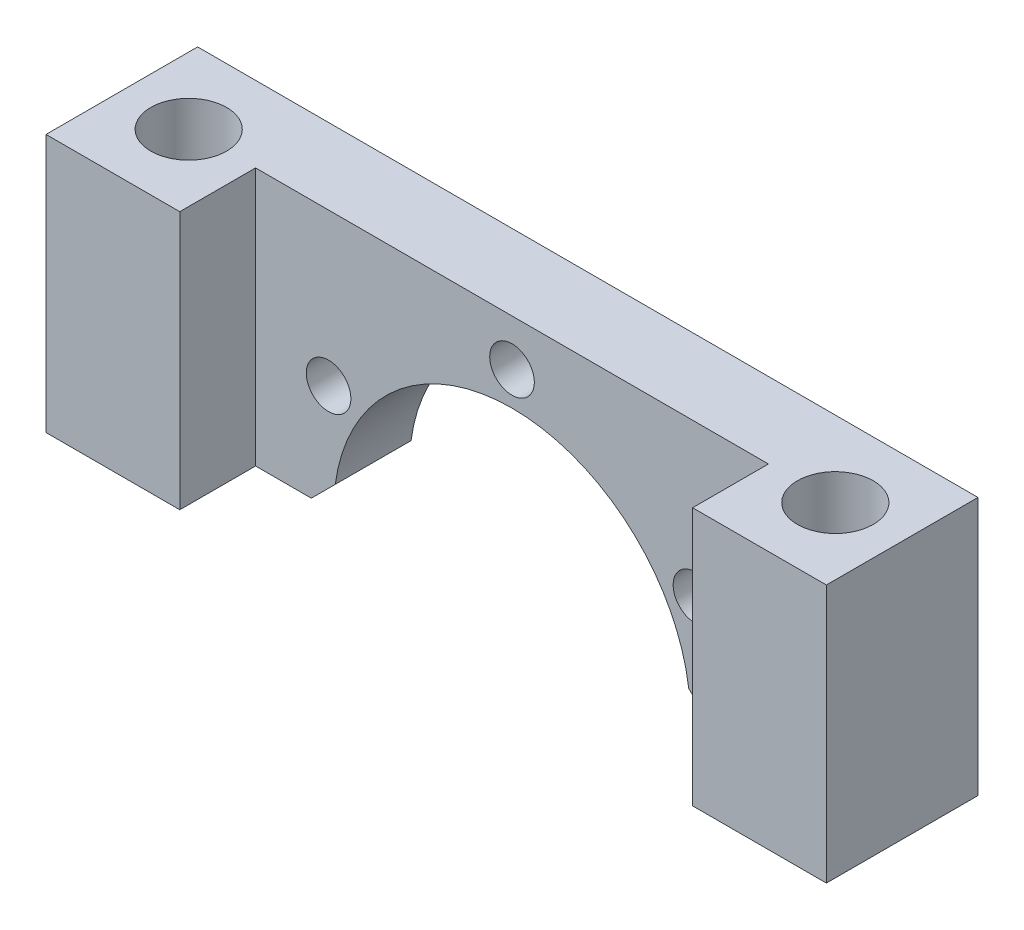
ISO-10303-21;
HEADER;
FILE_DESCRIPTION(('STEP AP214'),'2;1');
FILE_NAME('part.step','',(''),(''),'','','');
FILE_SCHEMA(('AUTOMOTIVE_DESIGN { 1 0 10303 214 1 1 1 1 }'));
ENDSEC;
DATA;
#1=APPLICATION_CONTEXT('core data for automotive mechanical design processes');
#2=APPLICATION_PROTOCOL_DEFINITION('international standard','automotive_design',2000,#1);
#3=PRODUCT_CONTEXT('',#1,'mechanical');
#4=PRODUCT('Part','Part','',(#3));
#5=PRODUCT_RELATED_PRODUCT_CATEGORY('part','',(#4));
#6=PRODUCT_DEFINITION_FORMATION('','',#4);
#7=PRODUCT_DEFINITION_CONTEXT('part definition',#1,'design');
#8=PRODUCT_DEFINITION('design','',#6,#7);
#9=PRODUCT_DEFINITION_SHAPE('','',#8);
#10=(LENGTH_UNIT() NAMED_UNIT(*) SI_UNIT(.MILLI.,.METRE.));
#11=(NAMED_UNIT(*) PLANE_ANGLE_UNIT() SI_UNIT($,.RADIAN.));
#12=(NAMED_UNIT(*) SI_UNIT($,.STERADIAN.) SOLID_ANGLE_UNIT());
#13=UNCERTAINTY_MEASURE_WITH_UNIT(LENGTH_MEASURE(1.E-05),#10,'distance_accuracy_value','');
#14=(GEOMETRIC_REPRESENTATION_CONTEXT(3) GLOBAL_UNCERTAINTY_ASSIGNED_CONTEXT((#13)) GLOBAL_UNIT_ASSIGNED_CONTEXT((#10,
#11,#12)) REPRESENTATION_CONTEXT('',''));
#15=CARTESIAN_POINT('',(0.,0.,0.));
#16=DIRECTION('',(0.,0.,1.));
#17=DIRECTION('',(1.,0.,0.));
#18=AXIS2_PLACEMENT_3D('',#15,#16,#17);
#19=CARTESIAN_POINT('',(0.,0.,3.4));
#20=DIRECTION('',(0.,0.,-1.));
#21=DIRECTION('',(-1.,0.,0.));
#22=AXIS2_PLACEMENT_3D('',#19,#20,#21);
#23=PLANE('',#22);
#24=CARTESIAN_POINT('',(8.22724133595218,4.74999999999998,3.4));
#25=DIRECTION('',(0.,0.,-1.));
#26=DIRECTION('',(-1.,0.,0.));
#27=AXIS2_PLACEMENT_3D('',#24,#25,#26);
#28=CIRCLE('',#27,1.);
#29=CARTESIAN_POINT('',(7.22724133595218,4.74999999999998,3.4));
#30=VERTEX_POINT('',#29);
#31=EDGE_CURVE('E358',#30,#30,#28,.T.);
#32=ORIENTED_EDGE('',*,*,#31,.T.);
#33=EDGE_LOOP('',(#32));
#34=FACE_BOUND('',#33,.T.);
#35=CARTESIAN_POINT('',(0.,9.5,3.4));
#36=DIRECTION('',(0.,0.,-1.));
#37=DIRECTION('',(-1.,0.,0.));
#38=AXIS2_PLACEMENT_3D('',#35,#36,#37);
#39=CIRCLE('',#38,1.);
#40=CARTESIAN_POINT('',(-1.,9.5,3.4));
#41=VERTEX_POINT('',#40);
#42=EDGE_CURVE('E365',#41,#41,#39,.T.);
#43=ORIENTED_EDGE('',*,*,#42,.T.);
#44=EDGE_LOOP('',(#43));
#45=FACE_BOUND('',#44,.T.);
#46=CARTESIAN_POINT('',(-8.22724133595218,4.74999999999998,3.4));
#47=DIRECTION('',(0.,0.,-1.));
#48=DIRECTION('',(-1.,0.,0.));
#49=AXIS2_PLACEMENT_3D('',#46,#47,#48);
#50=CIRCLE('',#49,1.);
#51=CARTESIAN_POINT('',(-9.22724133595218,4.74999999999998,3.4));
#52=VERTEX_POINT('',#51);
#53=EDGE_CURVE('E369',#52,#52,#50,.T.);
#54=ORIENTED_EDGE('',*,*,#53,.T.);
#55=EDGE_LOOP('',(#54));
#56=FACE_BOUND('',#55,.T.);
#57=DIRECTION('',(1.,0.,0.));
#58=VECTOR('',#57,1.);
#59=CARTESIAN_POINT('',(-8.,0.,3.4));
#60=LINE('',#59,#58);
#61=CARTESIAN_POINT('',(-11.5,0.,3.4));
#62=VERTEX_POINT('',#61);
#63=CARTESIAN_POINT('',(-9.,0.,3.4));
#64=VERTEX_POINT('',#63);
#65=EDGE_CURVE('E222',#62,#64,#60,.T.);
#66=ORIENTED_EDGE('',*,*,#65,.T.);
#67=DIRECTION('',(-0.707106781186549,-0.707106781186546,0.));
#68=VECTOR('',#67,1.);
#69=CARTESIAN_POINT('',(-7.92782730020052,1.07217269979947,3.4));
#70=LINE('',#69,#68);
#71=CARTESIAN_POINT('',(-7.92782730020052,1.07217269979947,3.4));
#72=VERTEX_POINT('',#71);
#73=EDGE_CURVE('E51',#64,#72,#70,.F.);
#74=ORIENTED_EDGE('',*,*,#73,.T.);
#75=CARTESIAN_POINT('',(0.,0.,3.4));
#76=DIRECTION('',(0.,0.,-1.));
#77=DIRECTION('',(-1.,0.,0.));
#78=AXIS2_PLACEMENT_3D('',#75,#76,#77);
#79=CIRCLE('',#78,8.);
#80=CARTESIAN_POINT('',(7.92782730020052,1.07217269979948,3.4));
#81=VERTEX_POINT('',#80);
#82=EDGE_CURVE('E212',#72,#81,#79,.T.);
#83=ORIENTED_EDGE('',*,*,#82,.T.);
#84=DIRECTION('',(-0.707106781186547,0.707106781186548,0.));
#85=VECTOR('',#84,1.);
#86=CARTESIAN_POINT('',(9.,0.,3.4));
#87=LINE('',#86,#85);
#88=CARTESIAN_POINT('',(9.,0.,3.4));
#89=VERTEX_POINT('',#88);
#90=EDGE_CURVE('E58',#81,#89,#87,.F.);
#91=ORIENTED_EDGE('',*,*,#90,.T.);
#92=DIRECTION('',(1.,0.,0.));
#93=VECTOR('',#92,1.);
#94=CARTESIAN_POINT('',(17.5,0.,3.4));
#95=LINE('',#94,#93);
#96=CARTESIAN_POINT('',(11.5,0.,3.4));
#97=VERTEX_POINT('',#96);
#98=EDGE_CURVE('E215',#89,#97,#95,.T.);
#99=ORIENTED_EDGE('',*,*,#98,.T.);
#100=DIRECTION('',(0.,-1.,0.));
#101=VECTOR('',#100,1.);
#102=CARTESIAN_POINT('',(11.5,11.58,3.4));
#103=LINE('',#102,#101);
#104=CARTESIAN_POINT('',(11.5,11.58,3.4));
#105=VERTEX_POINT('',#104);
#106=EDGE_CURVE('E164',#105,#97,#103,.T.);
#107=ORIENTED_EDGE('',*,*,#106,.F.);
#108=DIRECTION('',(-1.,0.,0.));
#109=VECTOR('',#108,1.);
#110=CARTESIAN_POINT('',(-17.5,11.58,3.4));
#111=LINE('',#110,#109);
#112=CARTESIAN_POINT('',(-11.5,11.58,3.4));
#113=VERTEX_POINT('',#112);
#114=EDGE_CURVE('E219',#105,#113,#111,.T.);
#115=ORIENTED_EDGE('',*,*,#114,.T.);
#116=DIRECTION('',(0.,1.,0.));
#117=VECTOR('',#116,1.);
#118=CARTESIAN_POINT('',(-11.5,11.58,3.4));
#119=LINE('',#118,#117);
#120=EDGE_CURVE('E185',#62,#113,#119,.T.);
#121=ORIENTED_EDGE('',*,*,#120,.F.);
#122=EDGE_LOOP('',(#66,#74,#83,#91,#99,#107,#115,#121));
#123=FACE_BOUND('',#122,.T.);
#124=ADVANCED_FACE('F41',(#34,#45,#56,#123),#23,.F.);
#125=CARTESIAN_POINT('',(0.,0.,3.4));
#126=DIRECTION('',(0.,0.,-1.));
#127=DIRECTION('',(-1.,0.,0.));
#128=AXIS2_PLACEMENT_3D('',#125,#126,#127);
#129=CYLINDRICAL_SURFACE('',#128,8.);
#130=ORIENTED_EDGE('',*,*,#82,.F.);
#131=DIRECTION('',(0.,0.,-1.));
#132=VECTOR('',#131,1.);
#133=CARTESIAN_POINT('',(-7.92782730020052,1.07217269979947,3.4));
#134=LINE('',#133,#132);
#135=CARTESIAN_POINT('',(-7.92782730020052,1.07217269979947,0.));
#136=VERTEX_POINT('',#135);
#137=EDGE_CURVE('E253',#72,#136,#134,.T.);
#138=ORIENTED_EDGE('',*,*,#137,.T.);
#139=CARTESIAN_POINT('',(0.,0.,0.));
#140=DIRECTION('',(0.,0.,-1.));
#141=DIRECTION('',(-1.,0.,0.));
#142=AXIS2_PLACEMENT_3D('',#139,#140,#141);
#143=CIRCLE('',#142,8.);
#144=CARTESIAN_POINT('',(7.92782730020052,1.07217269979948,0.));
#145=VERTEX_POINT('',#144);
#146=EDGE_CURVE('E211',#136,#145,#143,.T.);
#147=ORIENTED_EDGE('',*,*,#146,.T.);
#148=DIRECTION('',(0.,0.,-1.));
#149=VECTOR('',#148,1.);
#150=CARTESIAN_POINT('',(7.92782730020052,1.07217269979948,3.4));
#151=LINE('',#150,#149);
#152=EDGE_CURVE('E250',#145,#81,#151,.F.);
#153=ORIENTED_EDGE('',*,*,#152,.T.);
#154=EDGE_LOOP('',(#130,#138,#147,#153));
#155=FACE_BOUND('',#154,.T.);
#156=ADVANCED_FACE('F273',(#155),#129,.F.);
#157=CARTESIAN_POINT('',(17.5,0.,3.4));
#158=DIRECTION('',(0.,1.,0.));
#159=DIRECTION('',(-1.,0.,0.));
#160=AXIS2_PLACEMENT_3D('',#157,#158,#159);
#161=PLANE('',#160);
#162=CARTESIAN_POINT('',(14.5,0.,3.4));
#163=DIRECTION('',(0.,1.,0.));
#164=DIRECTION('',(0.,0.,-1.));
#165=AXIS2_PLACEMENT_3D('',#162,#163,#164);
#166=CIRCLE('',#165,1.7);
#167=CARTESIAN_POINT('',(14.5,0.,1.7));
#168=VERTEX_POINT('',#167);
#169=EDGE_CURVE('E348',#168,#168,#166,.T.);
#170=ORIENTED_EDGE('',*,*,#169,.T.);
#171=EDGE_LOOP('',(#170));
#172=FACE_BOUND('',#171,.T.);
#173=ORIENTED_EDGE('',*,*,#98,.F.);
#174=DIRECTION('',(0.,0.,-1.));
#175=VECTOR('',#174,1.);
#176=CARTESIAN_POINT('',(9.,0.,3.4));
#177=LINE('',#176,#175);
#178=CARTESIAN_POINT('',(9.,0.,0.));
#179=VERTEX_POINT('',#178);
#180=EDGE_CURVE('E11',#89,#179,#177,.T.);
#181=ORIENTED_EDGE('',*,*,#180,.T.);
#182=DIRECTION('',(1.,0.,0.));
#183=VECTOR('',#182,1.);
#184=CARTESIAN_POINT('',(17.5,0.,0.));
#185=LINE('',#184,#183);
#186=CARTESIAN_POINT('',(17.5,0.,0.));
#187=VERTEX_POINT('',#186);
#188=EDGE_CURVE('E229',#179,#187,#185,.T.);
#189=ORIENTED_EDGE('',*,*,#188,.T.);
#190=DIRECTION('',(0.,0.,-1.));
#191=VECTOR('',#190,1.);
#192=CARTESIAN_POINT('',(17.5,0.,3.4));
#193=LINE('',#192,#191);
#194=CARTESIAN_POINT('',(17.5,0.,6.8));
#195=VERTEX_POINT('',#194);
#196=EDGE_CURVE('E146',#195,#187,#193,.T.);
#197=ORIENTED_EDGE('',*,*,#196,.F.);
#198=DIRECTION('',(1.,0.,0.));
#199=VECTOR('',#198,1.);
#200=CARTESIAN_POINT('',(17.5,0.,6.8));
#201=LINE('',#200,#199);
#202=CARTESIAN_POINT('',(11.5,0.,6.8));
#203=VERTEX_POINT('',#202);
#204=EDGE_CURVE('E162',#203,#195,#201,.T.);
#205=ORIENTED_EDGE('',*,*,#204,.F.);
#206=DIRECTION('',(0.,0.,-1.));
#207=VECTOR('',#206,1.);
#208=CARTESIAN_POINT('',(11.5,0.,6.8));
#209=LINE('',#208,#207);
#210=EDGE_CURVE('E178',#203,#97,#209,.T.);
#211=ORIENTED_EDGE('',*,*,#210,.T.);
#212=EDGE_LOOP('',(#173,#181,#189,#197,#205,#211));
#213=FACE_BOUND('',#212,.T.);
#214=ADVANCED_FACE('F300',(#172,#213),#161,.F.);
#215=CARTESIAN_POINT('',(17.5,11.58,3.4));
#216=DIRECTION('',(-1.,0.,0.));
#217=DIRECTION('',(0.,0.,1.));
#218=AXIS2_PLACEMENT_3D('',#215,#216,#217);
#219=PLANE('',#218);
#220=DIRECTION('',(0.,1.,0.));
#221=VECTOR('',#220,1.);
#222=CARTESIAN_POINT('',(17.5,11.58,0.));
#223=LINE('',#222,#221);
#224=CARTESIAN_POINT('',(17.5,11.58,0.));
#225=VERTEX_POINT('',#224);
#226=EDGE_CURVE('E142',#187,#225,#223,.T.);
#227=ORIENTED_EDGE('',*,*,#226,.T.);
#228=DIRECTION('',(0.,0.,-1.));
#229=VECTOR('',#228,1.);
#230=CARTESIAN_POINT('',(17.5,11.58,3.4));
#231=LINE('',#230,#229);
#232=CARTESIAN_POINT('',(17.5,11.58,6.8));
#233=VERTEX_POINT('',#232);
#234=EDGE_CURVE('E135',#233,#225,#231,.T.);
#235=ORIENTED_EDGE('',*,*,#234,.F.);
#236=DIRECTION('',(0.,1.,0.));
#237=VECTOR('',#236,1.);
#238=CARTESIAN_POINT('',(17.5,11.58,6.8));
#239=LINE('',#238,#237);
#240=EDGE_CURVE('E140',#195,#233,#239,.T.);
#241=ORIENTED_EDGE('',*,*,#240,.F.);
#242=ORIENTED_EDGE('',*,*,#196,.T.);
#243=EDGE_LOOP('',(#227,#235,#241,#242));
#244=FACE_BOUND('',#243,.T.);
#245=ADVANCED_FACE('F137',(#244),#219,.F.);
#246=CARTESIAN_POINT('',(-17.5,11.58,3.4));
#247=DIRECTION('',(0.,-1.,0.));
#248=DIRECTION('',(0.,0.,-1.));
#249=AXIS2_PLACEMENT_3D('',#246,#247,#248);
#250=PLANE('',#249);
#251=CARTESIAN_POINT('',(-14.5,11.58,3.4));
#252=DIRECTION('',(0.,1.,0.));
#253=DIRECTION('',(0.,0.,1.));
#254=AXIS2_PLACEMENT_3D('',#251,#252,#253);
#255=CIRCLE('',#254,1.7);
#256=CARTESIAN_POINT('',(-14.5,11.58,5.1));
#257=VERTEX_POINT('',#256);
#258=EDGE_CURVE('E351',#257,#257,#255,.T.);
#259=ORIENTED_EDGE('',*,*,#258,.F.);
#260=EDGE_LOOP('',(#259));
#261=FACE_BOUND('',#260,.T.);
#262=CARTESIAN_POINT('',(14.5,11.58,3.4));
#263=DIRECTION('',(0.,1.,0.));
#264=DIRECTION('',(0.,0.,-1.));
#265=AXIS2_PLACEMENT_3D('',#262,#263,#264);
#266=CIRCLE('',#265,1.7);
#267=CARTESIAN_POINT('',(14.5,11.58,1.7));
#268=VERTEX_POINT('',#267);
#269=EDGE_CURVE('E172',#268,#268,#266,.T.);
#270=ORIENTED_EDGE('',*,*,#269,.F.);
#271=EDGE_LOOP('',(#270));
#272=FACE_BOUND('',#271,.T.);
#273=DIRECTION('',(-1.,0.,0.));
#274=VECTOR('',#273,1.);
#275=CARTESIAN_POINT('',(-17.5,11.58,0.));
#276=LINE('',#275,#274);
#277=CARTESIAN_POINT('',(-17.5,11.58,0.));
#278=VERTEX_POINT('',#277);
#279=EDGE_CURVE('E234',#225,#278,#276,.T.);
#280=ORIENTED_EDGE('',*,*,#279,.T.);
#281=DIRECTION('',(0.,0.,-1.));
#282=VECTOR('',#281,1.);
#283=CARTESIAN_POINT('',(-17.5,11.58,3.4));
#284=LINE('',#283,#282);
#285=CARTESIAN_POINT('',(-17.5,11.58,6.8));
#286=VERTEX_POINT('',#285);
#287=EDGE_CURVE('E147',#286,#278,#284,.T.);
#288=ORIENTED_EDGE('',*,*,#287,.F.);
#289=DIRECTION('',(-1.,0.,0.));
#290=VECTOR('',#289,1.);
#291=CARTESIAN_POINT('',(-17.5,11.58,6.8));
#292=LINE('',#291,#290);
#293=CARTESIAN_POINT('',(-11.5,11.58,6.8));
#294=VERTEX_POINT('',#293);
#295=EDGE_CURVE('E196',#294,#286,#292,.T.);
#296=ORIENTED_EDGE('',*,*,#295,.F.);
#297=DIRECTION('',(0.,0.,-1.));
#298=VECTOR('',#297,1.);
#299=CARTESIAN_POINT('',(-11.5,11.58,6.8));
#300=LINE('',#299,#298);
#301=EDGE_CURVE('E200',#294,#113,#300,.T.);
#302=ORIENTED_EDGE('',*,*,#301,.T.);
#303=ORIENTED_EDGE('',*,*,#114,.F.);
#304=DIRECTION('',(0.,0.,-1.));
#305=VECTOR('',#304,1.);
#306=CARTESIAN_POINT('',(11.5,11.58,6.8));
#307=LINE('',#306,#305);
#308=CARTESIAN_POINT('',(11.5,11.58,6.8));
#309=VERTEX_POINT('',#308);
#310=EDGE_CURVE('E153',#309,#105,#307,.T.);
#311=ORIENTED_EDGE('',*,*,#310,.F.);
#312=DIRECTION('',(-1.,0.,0.));
#313=VECTOR('',#312,1.);
#314=CARTESIAN_POINT('',(17.5,11.58,6.8));
#315=LINE('',#314,#313);
#316=EDGE_CURVE('E150',#233,#309,#315,.T.);
#317=ORIENTED_EDGE('',*,*,#316,.F.);
#318=ORIENTED_EDGE('',*,*,#234,.T.);
#319=EDGE_LOOP('',(#280,#288,#296,#302,#303,#311,#317,#318));
#320=FACE_BOUND('',#319,.T.);
#321=ADVANCED_FACE('F151',(#261,#272,#320),#250,.F.);
#322=CARTESIAN_POINT('',(-17.5,0.,3.4));
#323=DIRECTION('',(1.,0.,0.));
#324=DIRECTION('',(0.,0.,-1.));
#325=AXIS2_PLACEMENT_3D('',#322,#323,#324);
#326=PLANE('',#325);
#327=DIRECTION('',(0.,-1.,0.));
#328=VECTOR('',#327,1.);
#329=CARTESIAN_POINT('',(-17.5,0.,0.));
#330=LINE('',#329,#328);
#331=CARTESIAN_POINT('',(-17.5,0.,0.));
#332=VERTEX_POINT('',#331);
#333=EDGE_CURVE('E237',#278,#332,#330,.T.);
#334=ORIENTED_EDGE('',*,*,#333,.T.);
#335=DIRECTION('',(0.,0.,-1.));
#336=VECTOR('',#335,1.);
#337=CARTESIAN_POINT('',(-17.5,0.,3.4));
#338=LINE('',#337,#336);
#339=CARTESIAN_POINT('',(-17.5,0.,6.8));
#340=VERTEX_POINT('',#339);
#341=EDGE_CURVE('E225',#340,#332,#338,.T.);
#342=ORIENTED_EDGE('',*,*,#341,.F.);
#343=DIRECTION('',(0.,-1.,0.));
#344=VECTOR('',#343,1.);
#345=CARTESIAN_POINT('',(-17.5,11.58,6.8));
#346=LINE('',#345,#344);
#347=EDGE_CURVE('E186',#286,#340,#346,.T.);
#348=ORIENTED_EDGE('',*,*,#347,.F.);
#349=ORIENTED_EDGE('',*,*,#287,.T.);
#350=EDGE_LOOP('',(#334,#342,#348,#349));
#351=FACE_BOUND('',#350,.T.);
#352=ADVANCED_FACE('F286',(#351),#326,.F.);
#353=CARTESIAN_POINT('',(-8.,0.,3.4));
#354=DIRECTION('',(0.,1.,0.));
#355=DIRECTION('',(-1.,0.,0.));
#356=AXIS2_PLACEMENT_3D('',#353,#354,#355);
#357=PLANE('',#356);
#358=CARTESIAN_POINT('',(-14.5,0.,3.4));
#359=DIRECTION('',(0.,1.,0.));
#360=DIRECTION('',(0.,0.,1.));
#361=AXIS2_PLACEMENT_3D('',#358,#359,#360);
#362=CIRCLE('',#361,1.7);
#363=CARTESIAN_POINT('',(-14.5,0.,5.1));
#364=VERTEX_POINT('',#363);
#365=EDGE_CURVE('E169',#364,#364,#362,.T.);
#366=ORIENTED_EDGE('',*,*,#365,.T.);
#367=EDGE_LOOP('',(#366));
#368=FACE_BOUND('',#367,.T.);
#369=DIRECTION('',(1.,0.,0.));
#370=VECTOR('',#369,1.);
#371=CARTESIAN_POINT('',(-8.,0.,0.));
#372=LINE('',#371,#370);
#373=CARTESIAN_POINT('',(-9.,0.,0.));
#374=VERTEX_POINT('',#373);
#375=EDGE_CURVE('E216',#332,#374,#372,.T.);
#376=ORIENTED_EDGE('',*,*,#375,.T.);
#377=DIRECTION('',(0.,0.,1.));
#378=VECTOR('',#377,1.);
#379=CARTESIAN_POINT('',(-9.,0.,3.4));
#380=LINE('',#379,#378);
#381=EDGE_CURVE('E66',#374,#64,#380,.T.);
#382=ORIENTED_EDGE('',*,*,#381,.T.);
#383=ORIENTED_EDGE('',*,*,#65,.F.);
#384=DIRECTION('',(0.,0.,-1.));
#385=VECTOR('',#384,1.);
#386=CARTESIAN_POINT('',(-11.5,0.,6.8));
#387=LINE('',#386,#385);
#388=CARTESIAN_POINT('',(-11.5,0.,6.8));
#389=VERTEX_POINT('',#388);
#390=EDGE_CURVE('E207',#389,#62,#387,.T.);
#391=ORIENTED_EDGE('',*,*,#390,.F.);
#392=DIRECTION('',(1.,0.,0.));
#393=VECTOR('',#392,1.);
#394=CARTESIAN_POINT('',(-17.5,0.,6.8));
#395=LINE('',#394,#393);
#396=EDGE_CURVE('E190',#340,#389,#395,.T.);
#397=ORIENTED_EDGE('',*,*,#396,.F.);
#398=ORIENTED_EDGE('',*,*,#341,.T.);
#399=EDGE_LOOP('',(#376,#382,#383,#391,#397,#398));
#400=FACE_BOUND('',#399,.T.);
#401=ADVANCED_FACE('F281',(#368,#400),#357,.F.);
#402=CARTESIAN_POINT('',(0.,0.,0.));
#403=DIRECTION('',(0.,0.,-1.));
#404=DIRECTION('',(-1.,0.,0.));
#405=AXIS2_PLACEMENT_3D('',#402,#403,#404);
#406=PLANE('',#405);
#407=CARTESIAN_POINT('',(8.22724133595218,4.74999999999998,0.));
#408=DIRECTION('',(0.,0.,-1.));
#409=DIRECTION('',(-1.,0.,0.));
#410=AXIS2_PLACEMENT_3D('',#407,#408,#409);
#411=CIRCLE('',#410,1.);
#412=CARTESIAN_POINT('',(7.22724133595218,4.74999999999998,0.));
#413=VERTEX_POINT('',#412);
#414=EDGE_CURVE('E373',#413,#413,#411,.T.);
#415=ORIENTED_EDGE('',*,*,#414,.F.);
#416=EDGE_LOOP('',(#415));
#417=FACE_BOUND('',#416,.T.);
#418=CARTESIAN_POINT('',(0.,9.5,0.));
#419=DIRECTION('',(0.,0.,-1.));
#420=DIRECTION('',(-1.,0.,0.));
#421=AXIS2_PLACEMENT_3D('',#418,#419,#420);
#422=CIRCLE('',#421,1.);
#423=CARTESIAN_POINT('',(-1.,9.5,0.));
#424=VERTEX_POINT('',#423);
#425=EDGE_CURVE('E378',#424,#424,#422,.T.);
#426=ORIENTED_EDGE('',*,*,#425,.F.);
#427=EDGE_LOOP('',(#426));
#428=FACE_BOUND('',#427,.T.);
#429=CARTESIAN_POINT('',(-8.22724133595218,4.74999999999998,0.));
#430=DIRECTION('',(0.,0.,-1.));
#431=DIRECTION('',(-1.,0.,0.));
#432=AXIS2_PLACEMENT_3D('',#429,#430,#431);
#433=CIRCLE('',#432,1.);
#434=CARTESIAN_POINT('',(-9.22724133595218,4.74999999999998,0.));
#435=VERTEX_POINT('',#434);
#436=EDGE_CURVE('E374',#435,#435,#433,.T.);
#437=ORIENTED_EDGE('',*,*,#436,.F.);
#438=EDGE_LOOP('',(#437));
#439=FACE_BOUND('',#438,.T.);
#440=ORIENTED_EDGE('',*,*,#146,.F.);
#441=DIRECTION('',(0.707106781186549,0.707106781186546,0.));
#442=VECTOR('',#441,1.);
#443=CARTESIAN_POINT('',(-4.49999999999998,4.5,0.));
#444=LINE('',#443,#442);
#445=EDGE_CURVE('E260',#136,#374,#444,.F.);
#446=ORIENTED_EDGE('',*,*,#445,.T.);
#447=ORIENTED_EDGE('',*,*,#375,.F.);
#448=ORIENTED_EDGE('',*,*,#333,.F.);
#449=ORIENTED_EDGE('',*,*,#279,.F.);
#450=ORIENTED_EDGE('',*,*,#226,.F.);
#451=ORIENTED_EDGE('',*,*,#188,.F.);
#452=DIRECTION('',(0.707106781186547,-0.707106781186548,0.));
#453=VECTOR('',#452,1.);
#454=CARTESIAN_POINT('',(4.5,4.5,0.));
#455=LINE('',#454,#453);
#456=EDGE_CURVE('E257',#179,#145,#455,.F.);
#457=ORIENTED_EDGE('',*,*,#456,.T.);
#458=EDGE_LOOP('',(#440,#446,#447,#448,#449,#450,#451,#457));
#459=FACE_BOUND('',#458,.T.);
#460=ADVANCED_FACE('F279',(#417,#428,#439,#459),#406,.T.);
#461=CARTESIAN_POINT('',(-11.5,11.58,6.8));
#462=DIRECTION('',(-1.,0.,0.));
#463=DIRECTION('',(0.,-1.,0.));
#464=AXIS2_PLACEMENT_3D('',#461,#462,#463);
#465=PLANE('',#464);
#466=ORIENTED_EDGE('',*,*,#120,.T.);
#467=ORIENTED_EDGE('',*,*,#301,.F.);
#468=DIRECTION('',(0.,1.,0.));
#469=VECTOR('',#468,1.);
#470=CARTESIAN_POINT('',(-11.5,11.58,6.8));
#471=LINE('',#470,#469);
#472=EDGE_CURVE('E193',#389,#294,#471,.T.);
#473=ORIENTED_EDGE('',*,*,#472,.F.);
#474=ORIENTED_EDGE('',*,*,#390,.T.);
#475=EDGE_LOOP('',(#466,#467,#473,#474));
#476=FACE_BOUND('',#475,.T.);
#477=ADVANCED_FACE('F294',(#476),#465,.F.);
#478=CARTESIAN_POINT('',(0.,0.,6.8));
#479=DIRECTION('',(0.,0.,1.));
#480=DIRECTION('',(1.,0.,0.));
#481=AXIS2_PLACEMENT_3D('',#478,#479,#480);
#482=PLANE('',#481);
#483=ORIENTED_EDGE('',*,*,#347,.T.);
#484=ORIENTED_EDGE('',*,*,#396,.T.);
#485=ORIENTED_EDGE('',*,*,#472,.T.);
#486=ORIENTED_EDGE('',*,*,#295,.T.);
#487=EDGE_LOOP('',(#483,#484,#485,#486));
#488=FACE_BOUND('',#487,.T.);
#489=ADVANCED_FACE('F290',(#488),#482,.T.);
#490=CARTESIAN_POINT('',(11.5,11.58,6.8));
#491=DIRECTION('',(1.,0.,0.));
#492=DIRECTION('',(0.,1.,0.));
#493=AXIS2_PLACEMENT_3D('',#490,#491,#492);
#494=PLANE('',#493);
#495=ORIENTED_EDGE('',*,*,#106,.T.);
#496=ORIENTED_EDGE('',*,*,#210,.F.);
#497=DIRECTION('',(0.,-1.,0.));
#498=VECTOR('',#497,1.);
#499=CARTESIAN_POINT('',(11.5,11.58,6.8));
#500=LINE('',#499,#498);
#501=EDGE_CURVE('E157',#309,#203,#500,.T.);
#502=ORIENTED_EDGE('',*,*,#501,.F.);
#503=ORIENTED_EDGE('',*,*,#310,.T.);
#504=EDGE_LOOP('',(#495,#496,#502,#503));
#505=FACE_BOUND('',#504,.T.);
#506=ADVANCED_FACE('F298',(#505),#494,.F.);
#507=CARTESIAN_POINT('',(0.,0.,6.8));
#508=DIRECTION('',(0.,0.,-1.));
#509=DIRECTION('',(-1.,0.,0.));
#510=AXIS2_PLACEMENT_3D('',#507,#508,#509);
#511=PLANE('',#510);
#512=ORIENTED_EDGE('',*,*,#240,.T.);
#513=ORIENTED_EDGE('',*,*,#316,.T.);
#514=ORIENTED_EDGE('',*,*,#501,.T.);
#515=ORIENTED_EDGE('',*,*,#204,.T.);
#516=EDGE_LOOP('',(#512,#513,#514,#515));
#517=FACE_BOUND('',#516,.T.);
#518=ADVANCED_FACE('F160',(#517),#511,.F.);
#519=CARTESIAN_POINT('',(-7.92782730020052,1.07217269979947,3.4));
#520=DIRECTION('',(-0.707106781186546,0.707106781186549,0.));
#521=DIRECTION('',(0.,0.,-1.));
#522=AXIS2_PLACEMENT_3D('',#519,#520,#521);
#523=PLANE('',#522);
#524=ORIENTED_EDGE('',*,*,#73,.F.);
#525=ORIENTED_EDGE('',*,*,#381,.F.);
#526=ORIENTED_EDGE('',*,*,#445,.F.);
#527=ORIENTED_EDGE('',*,*,#137,.F.);
#528=EDGE_LOOP('',(#524,#525,#526,#527));
#529=FACE_BOUND('',#528,.T.);
#530=ADVANCED_FACE('F276',(#529),#523,.F.);
#531=CARTESIAN_POINT('',(9.,0.,3.4));
#532=DIRECTION('',(0.707106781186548,0.707106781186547,0.));
#533=DIRECTION('',(0.,0.,-1.));
#534=AXIS2_PLACEMENT_3D('',#531,#532,#533);
#535=PLANE('',#534);
#536=ORIENTED_EDGE('',*,*,#90,.F.);
#537=ORIENTED_EDGE('',*,*,#152,.F.);
#538=ORIENTED_EDGE('',*,*,#456,.F.);
#539=ORIENTED_EDGE('',*,*,#180,.F.);
#540=EDGE_LOOP('',(#536,#537,#538,#539));
#541=FACE_BOUND('',#540,.T.);
#542=ADVANCED_FACE('F44',(#541),#535,.F.);
#543=CARTESIAN_POINT('',(-14.5,0.,3.4));
#544=DIRECTION('',(0.,1.,0.));
#545=DIRECTION('',(0.,0.,1.));
#546=AXIS2_PLACEMENT_3D('',#543,#544,#545);
#547=CYLINDRICAL_SURFACE('',#546,1.7);
#548=ORIENTED_EDGE('',*,*,#365,.F.);
#549=EDGE_LOOP('',(#548));
#550=FACE_BOUND('',#549,.T.);
#551=ORIENTED_EDGE('',*,*,#258,.T.);
#552=EDGE_LOOP('',(#551));
#553=FACE_BOUND('',#552,.T.);
#554=ADVANCED_FACE('F304',(#550,#553),#547,.F.);
#555=CARTESIAN_POINT('',(14.5,0.,3.4));
#556=DIRECTION('',(0.,1.,0.));
#557=DIRECTION('',(0.,0.,1.));
#558=AXIS2_PLACEMENT_3D('',#555,#556,#557);
#559=CYLINDRICAL_SURFACE('',#558,1.7);
#560=ORIENTED_EDGE('',*,*,#169,.F.);
#561=EDGE_LOOP('',(#560));
#562=FACE_BOUND('',#561,.T.);
#563=ORIENTED_EDGE('',*,*,#269,.T.);
#564=EDGE_LOOP('',(#563));
#565=FACE_BOUND('',#564,.T.);
#566=ADVANCED_FACE('F309',(#562,#565),#559,.F.);
#567=CARTESIAN_POINT('',(-8.22724133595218,4.74999999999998,6.8));
#568=DIRECTION('',(0.,0.,-1.));
#569=DIRECTION('',(-1.,0.,0.));
#570=AXIS2_PLACEMENT_3D('',#567,#568,#569);
#571=CYLINDRICAL_SURFACE('',#570,1.);
#572=ORIENTED_EDGE('',*,*,#436,.T.);
#573=EDGE_LOOP('',(#572));
#574=FACE_BOUND('',#573,.T.);
#575=ORIENTED_EDGE('',*,*,#53,.F.);
#576=EDGE_LOOP('',(#575));
#577=FACE_BOUND('',#576,.T.);
#578=ADVANCED_FACE('F394',(#574,#577),#571,.F.);
#579=CARTESIAN_POINT('',(0.,9.5,6.8));
#580=DIRECTION('',(0.,0.,-1.));
#581=DIRECTION('',(-1.,0.,0.));
#582=AXIS2_PLACEMENT_3D('',#579,#580,#581);
#583=CYLINDRICAL_SURFACE('',#582,1.);
#584=ORIENTED_EDGE('',*,*,#425,.T.);
#585=EDGE_LOOP('',(#584));
#586=FACE_BOUND('',#585,.T.);
#587=ORIENTED_EDGE('',*,*,#42,.F.);
#588=EDGE_LOOP('',(#587));
#589=FACE_BOUND('',#588,.T.);
#590=ADVANCED_FACE('F397',(#586,#589),#583,.F.);
#591=CARTESIAN_POINT('',(8.22724133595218,4.74999999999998,6.8));
#592=DIRECTION('',(0.,0.,-1.));
#593=DIRECTION('',(-1.,0.,0.));
#594=AXIS2_PLACEMENT_3D('',#591,#592,#593);
#595=CYLINDRICAL_SURFACE('',#594,1.);
#596=ORIENTED_EDGE('',*,*,#414,.T.);
#597=EDGE_LOOP('',(#596));
#598=FACE_BOUND('',#597,.T.);
#599=ORIENTED_EDGE('',*,*,#31,.F.);
#600=EDGE_LOOP('',(#599));
#601=FACE_BOUND('',#600,.T.);
#602=ADVANCED_FACE('F387',(#598,#601),#595,.F.);
#603=CLOSED_SHELL('',(#124,#156,#214,#245,#321,#352,#401,#460,#477,#489,#506,#518,#530,#542,
#554,#566,#578,#590,#602));
#604=MANIFOLD_SOLID_BREP('B2',#603);
#605=ADVANCED_BREP_SHAPE_REPRESENTATION('',(#18,#604),#14);
#606=SHAPE_DEFINITION_REPRESENTATION(#9,#605);
ENDSEC;
END-ISO-10303-21;
